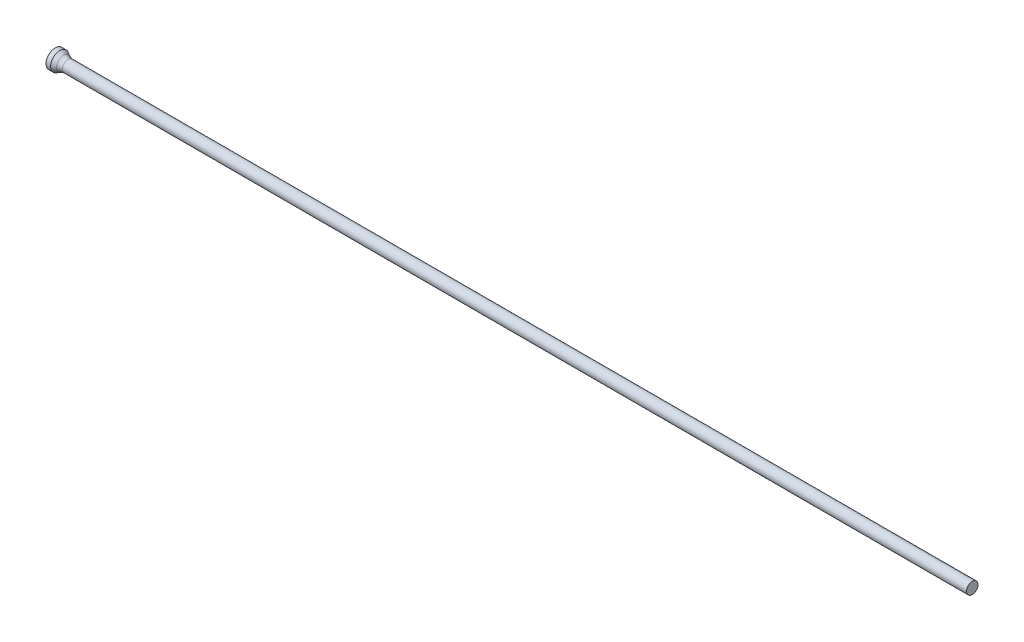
ISO-10303-21;
HEADER;
FILE_DESCRIPTION(('STEP AP214'),'2;1');
FILE_NAME('part.step','',(''),(''),'','','');
FILE_SCHEMA(('AUTOMOTIVE_DESIGN { 1 0 10303 214 1 1 1 1 }'));
ENDSEC;
DATA;
#1=APPLICATION_CONTEXT('core data for automotive mechanical design processes');
#2=APPLICATION_PROTOCOL_DEFINITION('international standard','automotive_design',2000,#1);
#3=PRODUCT_CONTEXT('',#1,'mechanical');
#4=PRODUCT('Part','Part','',(#3));
#5=PRODUCT_RELATED_PRODUCT_CATEGORY('part','',(#4));
#6=PRODUCT_DEFINITION_FORMATION('','',#4);
#7=PRODUCT_DEFINITION_CONTEXT('part definition',#1,'design');
#8=PRODUCT_DEFINITION('design','',#6,#7);
#9=PRODUCT_DEFINITION_SHAPE('','',#8);
#10=(LENGTH_UNIT() NAMED_UNIT(*) SI_UNIT(.MILLI.,.METRE.));
#11=(NAMED_UNIT(*) PLANE_ANGLE_UNIT() SI_UNIT($,.RADIAN.));
#12=(NAMED_UNIT(*) SI_UNIT($,.STERADIAN.) SOLID_ANGLE_UNIT());
#13=UNCERTAINTY_MEASURE_WITH_UNIT(LENGTH_MEASURE(1.E-05),#10,'distance_accuracy_value','');
#14=(GEOMETRIC_REPRESENTATION_CONTEXT(3) GLOBAL_UNCERTAINTY_ASSIGNED_CONTEXT((#13)) GLOBAL_UNIT_ASSIGNED_CONTEXT((#10,
#11,#12)) REPRESENTATION_CONTEXT('',''));
#15=CARTESIAN_POINT('',(0.,0.,0.));
#16=DIRECTION('',(0.,0.,1.));
#17=DIRECTION('',(1.,0.,0.));
#18=AXIS2_PLACEMENT_3D('',#15,#16,#17);
#19=CARTESIAN_POINT('',(0.,0.,0.));
#20=DIRECTION('',(1.,0.,0.));
#21=DIRECTION('',(0.,0.,-1.));
#22=AXIS2_PLACEMENT_3D('',#19,#20,#21);
#23=PLANE('',#22);
#24=CARTESIAN_POINT('',(0.,0.,0.));
#25=DIRECTION('',(-1.,0.,0.));
#26=DIRECTION('',(0.,0.,1.));
#27=AXIS2_PLACEMENT_3D('',#24,#25,#26);
#28=CIRCLE('',#27,1.);
#29=CARTESIAN_POINT('',(0.,0.,1.));
#30=VERTEX_POINT('',#29);
#31=EDGE_CURVE('E25',#30,#30,#28,.T.);
#32=ORIENTED_EDGE('',*,*,#31,.T.);
#33=EDGE_LOOP('',(#32));
#34=FACE_BOUND('',#33,.T.);
#35=ADVANCED_FACE('F14',(#34),#23,.F.);
#36=CARTESIAN_POINT('',(0.,0.,0.));
#37=DIRECTION('',(-1.,0.,0.));
#38=DIRECTION('',(0.,0.,1.));
#39=AXIS2_PLACEMENT_3D('',#36,#37,#38);
#40=CYLINDRICAL_SURFACE('',#39,1.);
#41=ORIENTED_EDGE('',*,*,#31,.F.);
#42=EDGE_LOOP('',(#41));
#43=FACE_BOUND('',#42,.T.);
#44=CARTESIAN_POINT('',(0.500480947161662,0.,0.));
#45=DIRECTION('',(-1.,0.,0.));
#46=DIRECTION('',(0.,0.,1.));
#47=AXIS2_PLACEMENT_3D('',#44,#45,#46);
#48=CIRCLE('',#47,1.);
#49=CARTESIAN_POINT('',(0.500480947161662,0.,1.));
#50=VERTEX_POINT('',#49);
#51=EDGE_CURVE('E29',#50,#50,#48,.T.);
#52=ORIENTED_EDGE('',*,*,#51,.T.);
#53=EDGE_LOOP('',(#52));
#54=FACE_BOUND('',#53,.T.);
#55=ADVANCED_FACE('F53',(#43,#54),#40,.T.);
#56=CARTESIAN_POINT('',(1.15,0.,0.));
#57=DIRECTION('',(-1.,0.,0.));
#58=DIRECTION('',(0.,0.,1.));
#59=AXIS2_PLACEMENT_3D('',#56,#57,#58);
#60=CONICAL_SURFACE('',#59,0.625,0.523598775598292);
#61=CARTESIAN_POINT('',(0.917949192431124,0.,0.));
#62=DIRECTION('',(-1.,0.,0.));
#63=DIRECTION('',(0.,0.,1.));
#64=AXIS2_PLACEMENT_3D('',#61,#62,#63);
#65=CIRCLE('',#64,0.758974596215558);
#66=CARTESIAN_POINT('',(0.917949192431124,0.,0.758974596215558));
#67=VERTEX_POINT('',#66);
#68=EDGE_CURVE('E21',#67,#67,#65,.T.);
#69=ORIENTED_EDGE('',*,*,#68,.T.);
#70=EDGE_LOOP('',(#69));
#71=FACE_BOUND('',#70,.T.);
#72=ORIENTED_EDGE('',*,*,#51,.F.);
#73=EDGE_LOOP('',(#72));
#74=FACE_BOUND('',#73,.T.);
#75=ADVANCED_FACE('F50',(#71,#74),#60,.T.);
#76=CARTESIAN_POINT('',(0.,0.,0.));
#77=DIRECTION('',(-1.,0.,0.));
#78=DIRECTION('',(0.,0.,1.));
#79=AXIS2_PLACEMENT_3D('',#76,#77,#78);
#80=CYLINDRICAL_SURFACE('',#79,0.625);
#81=CARTESIAN_POINT('',(1.41794919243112,0.,0.));
#82=DIRECTION('',(-1.,0.,0.));
#83=DIRECTION('',(0.,0.,1.));
#84=AXIS2_PLACEMENT_3D('',#81,#82,#83);
#85=CIRCLE('',#84,0.625);
#86=CARTESIAN_POINT('',(1.41794919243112,0.,0.625));
#87=VERTEX_POINT('',#86);
#88=EDGE_CURVE('E9',#87,#87,#85,.F.);
#89=ORIENTED_EDGE('',*,*,#88,.T.);
#90=EDGE_LOOP('',(#89));
#91=FACE_BOUND('',#90,.T.);
#92=CARTESIAN_POINT('',(100.,0.,0.));
#93=DIRECTION('',(-1.,0.,0.));
#94=DIRECTION('',(0.,0.,1.));
#95=AXIS2_PLACEMENT_3D('',#92,#93,#94);
#96=CIRCLE('',#95,0.625);
#97=CARTESIAN_POINT('',(100.,0.,0.625));
#98=VERTEX_POINT('',#97);
#99=EDGE_CURVE('E34',#98,#98,#96,.T.);
#100=ORIENTED_EDGE('',*,*,#99,.T.);
#101=EDGE_LOOP('',(#100));
#102=FACE_BOUND('',#101,.T.);
#103=ADVANCED_FACE('F38',(#91,#102),#80,.T.);
#104=CARTESIAN_POINT('',(100.,0.625,0.));
#105=DIRECTION('',(-1.,0.,0.));
#106=DIRECTION('',(0.,0.,1.));
#107=AXIS2_PLACEMENT_3D('',#104,#105,#106);
#108=PLANE('',#107);
#109=ORIENTED_EDGE('',*,*,#99,.F.);
#110=EDGE_LOOP('',(#109));
#111=FACE_BOUND('',#110,.T.);
#112=ADVANCED_FACE('F40',(#111),#108,.F.);
#113=CARTESIAN_POINT('',(1.41794919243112,0.,0.));
#114=DIRECTION('',(-1.,0.,0.));
#115=DIRECTION('',(0.,0.,1.));
#116=AXIS2_PLACEMENT_3D('',#113,#114,#115);
#117=TOROIDAL_SURFACE('',#116,1.625,1.);
#118=ORIENTED_EDGE('',*,*,#88,.F.);
#119=EDGE_LOOP('',(#118));
#120=FACE_BOUND('',#119,.T.);
#121=ORIENTED_EDGE('',*,*,#68,.F.);
#122=EDGE_LOOP('',(#121));
#123=FACE_BOUND('',#122,.T.);
#124=ADVANCED_FACE('F16',(#120,#123),#117,.F.);
#125=CLOSED_SHELL('',(#35,#55,#75,#103,#112,#124));
#126=MANIFOLD_SOLID_BREP('B1',#125);
#127=ADVANCED_BREP_SHAPE_REPRESENTATION('',(#18,#126),#14);
#128=SHAPE_DEFINITION_REPRESENTATION(#9,#127);
ENDSEC;
END-ISO-10303-21;
